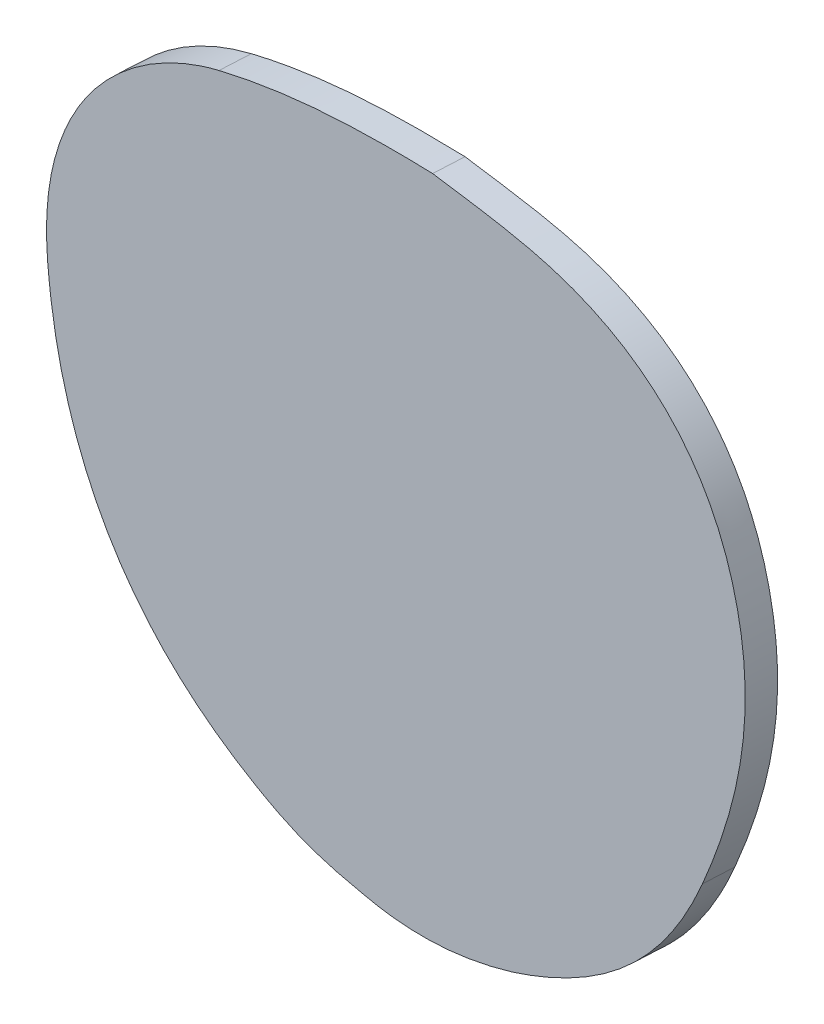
ISO-10303-21;
HEADER;
FILE_DESCRIPTION(('STEP AP214'),'2;1');
FILE_NAME('part.step','',(''),(''),'','','');
FILE_SCHEMA(('AUTOMOTIVE_DESIGN { 1 0 10303 214 1 1 1 1 }'));
ENDSEC;
DATA;
#1=APPLICATION_CONTEXT('core data for automotive mechanical design processes');
#2=APPLICATION_PROTOCOL_DEFINITION('international standard','automotive_design',2000,#1);
#3=PRODUCT_CONTEXT('',#1,'mechanical');
#4=PRODUCT('Part','Part','',(#3));
#5=PRODUCT_RELATED_PRODUCT_CATEGORY('part','',(#4));
#6=PRODUCT_DEFINITION_FORMATION('','',#4);
#7=PRODUCT_DEFINITION_CONTEXT('part definition',#1,'design');
#8=PRODUCT_DEFINITION('design','',#6,#7);
#9=PRODUCT_DEFINITION_SHAPE('','',#8);
#10=(LENGTH_UNIT() NAMED_UNIT(*) SI_UNIT(.MILLI.,.METRE.));
#11=(NAMED_UNIT(*) PLANE_ANGLE_UNIT() SI_UNIT($,.RADIAN.));
#12=(NAMED_UNIT(*) SI_UNIT($,.STERADIAN.) SOLID_ANGLE_UNIT());
#13=UNCERTAINTY_MEASURE_WITH_UNIT(LENGTH_MEASURE(1.E-05),#10,'distance_accuracy_value','');
#14=(GEOMETRIC_REPRESENTATION_CONTEXT(3) GLOBAL_UNCERTAINTY_ASSIGNED_CONTEXT((#13)) GLOBAL_UNIT_ASSIGNED_CONTEXT((#10,
#11,#12)) REPRESENTATION_CONTEXT('',''));
#15=CARTESIAN_POINT('',(0.,0.,0.));
#16=DIRECTION('',(0.,0.,1.));
#17=DIRECTION('',(1.,0.,0.));
#18=AXIS2_PLACEMENT_3D('',#15,#16,#17);
#19=CARTESIAN_POINT('',(66.9105713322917,14.0227928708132,27.8834045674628));
#20=CARTESIAN_POINT('',(66.081443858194,13.7430929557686,27.8399518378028));
#21=CARTESIAN_POINT('',(65.2419844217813,13.5010499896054,27.7959576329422));
#22=CARTESIAN_POINT('',(63.5373344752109,13.1107462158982,27.7066207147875));
#23=CARTESIAN_POINT('',(62.674721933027,12.9634372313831,27.66141310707));
#24=CARTESIAN_POINT('',(60.9373126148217,12.782456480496,27.5703593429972));
#25=CARTESIAN_POINT('',(60.0609155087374,12.7491919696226,27.5244293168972));
#26=CARTESIAN_POINT('',(58.3220449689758,12.8047402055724,27.4332989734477));
#27=CARTESIAN_POINT('',(57.4559455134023,12.8935967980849,27.3879086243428));
#28=CARTESIAN_POINT('',(56.5930362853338,13.0408700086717,27.3426854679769));
#29=B_SPLINE_CURVE_WITH_KNOTS('',3,(#19,#20,#21,#22,#23,#24,#25,#26,#27,#28),.UNSPECIFIED.,.F.,
.F.,(4,2,2,2,4),(0.,0.25,0.5,0.75,1.),.UNSPECIFIED.);
#30=DIRECTION('',(-0.0523359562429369,0.,0.998629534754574));
#31=VECTOR('',#30,1.);
#32=SURFACE_OF_LINEAR_EXTRUSION('',#29,#31);
#33=CARTESIAN_POINT('',(66.8058994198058,14.0227928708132,29.880663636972));
#34=CARTESIAN_POINT('',(65.9767719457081,13.7430929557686,29.837210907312));
#35=CARTESIAN_POINT('',(65.1373125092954,13.5010499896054,29.7932167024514));
#36=CARTESIAN_POINT('',(63.432662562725,13.1107462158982,29.7038797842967));
#37=CARTESIAN_POINT('',(62.5700500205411,12.9634372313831,29.6586721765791));
#38=CARTESIAN_POINT('',(60.8326407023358,12.7824564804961,29.5676184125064));
#39=CARTESIAN_POINT('',(59.9562435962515,12.7491919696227,29.5216883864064));
#40=CARTESIAN_POINT('',(58.21737305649,12.8047402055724,29.4305580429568));
#41=CARTESIAN_POINT('',(57.3512736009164,12.8935967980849,29.3851676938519));
#42=CARTESIAN_POINT('',(56.4883643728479,13.0408700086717,29.339944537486));
#43=B_SPLINE_CURVE_WITH_KNOTS('',3,(#33,#34,#35,#36,#37,#38,#39,#40,#41,#42),.UNSPECIFIED.,.F.,
.F.,(4,2,2,2,4),(0.,0.25,0.5,0.75,1.),.UNSPECIFIED.);
#44=CARTESIAN_POINT('',(66.8058994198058,14.0227928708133,29.880663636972));
#45=VERTEX_POINT('',#44);
#46=CARTESIAN_POINT('',(56.4883643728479,13.0408700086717,29.339944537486));
#47=VERTEX_POINT('',#46);
#48=EDGE_CURVE('E329',#45,#47,#43,.T.);
#49=ORIENTED_EDGE('',*,*,#48,.T.);
#50=DIRECTION('',(-0.0523359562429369,0.,0.998629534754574));
#51=VECTOR('',#50,1.);
#52=CARTESIAN_POINT('',(56.5930362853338,13.0408700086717,27.3426854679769));
#53=LINE('',#52,#51);
#54=CARTESIAN_POINT('',(56.5930362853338,13.0408700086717,27.3426854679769));
#55=VERTEX_POINT('',#54);
#56=EDGE_CURVE('E11',#55,#47,#53,.T.);
#57=ORIENTED_EDGE('',*,*,#56,.F.);
#58=CARTESIAN_POINT('',(56.5930362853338,13.0408700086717,27.3426854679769));
#59=CARTESIAN_POINT('',(57.4559455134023,12.8935967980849,27.3879086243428));
#60=CARTESIAN_POINT('',(58.3220449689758,12.8047402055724,27.4332989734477));
#61=CARTESIAN_POINT('',(60.0609155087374,12.7491919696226,27.5244293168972));
#62=CARTESIAN_POINT('',(60.9373126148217,12.782456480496,27.5703593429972));
#63=CARTESIAN_POINT('',(62.674721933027,12.9634372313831,27.66141310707));
#64=CARTESIAN_POINT('',(63.5373344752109,13.1107462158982,27.7066207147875));
#65=CARTESIAN_POINT('',(65.2419844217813,13.5010499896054,27.7959576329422));
#66=CARTESIAN_POINT('',(66.081443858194,13.7430929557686,27.8399518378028));
#67=CARTESIAN_POINT('',(66.9105713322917,14.0227928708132,27.8834045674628));
#68=B_SPLINE_CURVE_WITH_KNOTS('',3,(#58,#59,#60,#61,#62,#63,#64,#65,#66,#67),.UNSPECIFIED.,.F.,
.F.,(4,2,2,2,4),(0.,0.25,0.5,0.75,1.),.UNSPECIFIED.);
#69=CARTESIAN_POINT('',(66.9105713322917,14.0227928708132,27.8834045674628));
#70=VERTEX_POINT('',#69);
#71=EDGE_CURVE('E320',#70,#55,#68,.F.);
#72=ORIENTED_EDGE('',*,*,#71,.F.);
#73=DIRECTION('',(-0.0523359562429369,0.,0.998629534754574));
#74=VECTOR('',#73,1.);
#75=CARTESIAN_POINT('',(66.9105713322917,14.0227928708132,27.8834045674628));
#76=LINE('',#75,#74);
#77=EDGE_CURVE('E336',#70,#45,#76,.T.);
#78=ORIENTED_EDGE('',*,*,#77,.T.);
#79=EDGE_LOOP('',(#49,#57,#72,#78));
#80=FACE_BOUND('',#79,.T.);
#81=ADVANCED_FACE('F45',(#80),#32,.F.);
#82=CARTESIAN_POINT('',(56.5930362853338,13.0408700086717,27.3426854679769));
#83=CARTESIAN_POINT('',(55.9663635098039,13.1306969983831,27.3098429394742));
#84=CARTESIAN_POINT('',(55.3420453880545,13.2332759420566,27.2771238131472));
#85=CARTESIAN_POINT('',(54.1017208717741,13.4834471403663,27.2121211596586));
#86=CARTESIAN_POINT('',(53.4850531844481,13.631666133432,27.1798029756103));
#87=CARTESIAN_POINT('',(52.2731162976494,13.9922876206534,27.1162880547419));
#88=CARTESIAN_POINT('',(51.6762746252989,14.2064022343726,27.0850089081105));
#89=CARTESIAN_POINT('',(50.5070497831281,14.6916248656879,27.0237324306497));
#90=CARTESIAN_POINT('',(49.9343981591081,14.9611293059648,26.993721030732));
#91=CARTESIAN_POINT('',(49.3667500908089,15.2418839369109,26.9639718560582));
#92=B_SPLINE_CURVE_WITH_KNOTS('',3,(#82,#83,#84,#85,#86,#87,#88,#89,#90,#91),.UNSPECIFIED.,.F.,
.F.,(4,2,2,2,4),(0.,0.25,0.5,0.75,1.),.UNSPECIFIED.);
#93=DIRECTION('',(-0.0523359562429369,0.,0.998629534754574));
#94=VECTOR('',#93,1.);
#95=SURFACE_OF_LINEAR_EXTRUSION('',#92,#94);
#96=CARTESIAN_POINT('',(56.4883643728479,13.0408700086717,29.339944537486));
#97=CARTESIAN_POINT('',(55.861691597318,13.1306969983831,29.3071020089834));
#98=CARTESIAN_POINT('',(55.2373734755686,13.2332759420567,29.2743828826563));
#99=CARTESIAN_POINT('',(53.9970489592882,13.4834471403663,29.2093802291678));
#100=CARTESIAN_POINT('',(53.3803812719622,13.631666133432,29.1770620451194));
#101=CARTESIAN_POINT('',(52.1684443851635,13.9922876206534,29.1135471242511));
#102=CARTESIAN_POINT('',(51.571602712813,14.2064022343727,29.0822679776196));
#103=CARTESIAN_POINT('',(50.4023778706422,14.6916248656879,29.0209915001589));
#104=CARTESIAN_POINT('',(49.8297262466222,14.9611293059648,28.9909801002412));
#105=CARTESIAN_POINT('',(49.2620781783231,15.2418839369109,28.9612309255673));
#106=B_SPLINE_CURVE_WITH_KNOTS('',3,(#96,#97,#98,#99,#100,#101,#102,#103,#104,#105),
.UNSPECIFIED.,.F.,.F.,(4,2,2,2,4),(0.,0.25,0.5,0.75,1.),.UNSPECIFIED.);
#107=CARTESIAN_POINT('',(49.2620781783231,15.2418839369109,28.9612309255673));
#108=VERTEX_POINT('',#107);
#109=EDGE_CURVE('E327',#47,#108,#106,.T.);
#110=ORIENTED_EDGE('',*,*,#109,.T.);
#111=DIRECTION('',(-0.0523359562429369,0.,0.998629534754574));
#112=VECTOR('',#111,1.);
#113=CARTESIAN_POINT('',(49.3667500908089,15.2418839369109,26.9639718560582));
#114=LINE('',#113,#112);
#115=CARTESIAN_POINT('',(49.3667500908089,15.2418839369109,26.9639718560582));
#116=VERTEX_POINT('',#115);
#117=EDGE_CURVE('E59',#116,#108,#114,.T.);
#118=ORIENTED_EDGE('',*,*,#117,.F.);
#119=CARTESIAN_POINT('',(49.3667500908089,15.2418839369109,26.9639718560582));
#120=CARTESIAN_POINT('',(49.9343981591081,14.9611293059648,26.993721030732));
#121=CARTESIAN_POINT('',(50.5070497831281,14.6916248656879,27.0237324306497));
#122=CARTESIAN_POINT('',(51.6762746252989,14.2064022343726,27.0850089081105));
#123=CARTESIAN_POINT('',(52.2731162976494,13.9922876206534,27.1162880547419));
#124=CARTESIAN_POINT('',(53.4850531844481,13.631666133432,27.1798029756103));
#125=CARTESIAN_POINT('',(54.1017208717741,13.4834471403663,27.2121211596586));
#126=CARTESIAN_POINT('',(55.3420453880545,13.2332759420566,27.2771238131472));
#127=CARTESIAN_POINT('',(55.9663635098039,13.1306969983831,27.3098429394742));
#128=CARTESIAN_POINT('',(56.5930362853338,13.0408700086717,27.3426854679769));
#129=B_SPLINE_CURVE_WITH_KNOTS('',3,(#119,#120,#121,#122,#123,#124,#125,#126,#127,#128),
.UNSPECIFIED.,.F.,.F.,(4,2,2,2,4),(0.,0.25,0.5,0.75,1.),.UNSPECIFIED.);
#130=EDGE_CURVE('E111',#55,#116,#129,.F.);
#131=ORIENTED_EDGE('',*,*,#130,.F.);
#132=ORIENTED_EDGE('',*,*,#56,.T.);
#133=EDGE_LOOP('',(#110,#118,#131,#132));
#134=FACE_BOUND('',#133,.T.);
#135=ADVANCED_FACE('F239',(#134),#95,.F.);
#136=CARTESIAN_POINT('',(49.3667500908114,15.2418839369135,26.9639718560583));
#137=CARTESIAN_POINT('',(47.2853127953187,16.2713546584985,26.8548883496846));
#138=CARTESIAN_POINT('',(45.3523239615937,17.5123714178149,26.7535846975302));
#139=CARTESIAN_POINT('',(43.1720148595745,19.3998493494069,26.6393195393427));
#140=CARTESIAN_POINT('',(42.7473291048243,19.7947664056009,26.6170627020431));
#141=CARTESIAN_POINT('',(41.9253751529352,20.6186401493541,26.5739859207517));
#142=CARTESIAN_POINT('',(40.7468886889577,21.8919804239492,26.5122240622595));
#143=CARTESIAN_POINT('',(39.7294220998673,23.2763149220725,26.4589008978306));
#144=CARTESIAN_POINT('',(38.5116476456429,25.2178047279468,26.395080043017));
#145=CARTESIAN_POINT('',(37.9715387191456,26.237852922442,26.3667741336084));
#146=CARTESIAN_POINT('',(37.0283607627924,28.3646744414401,26.3173442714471));
#147=CARTESIAN_POINT('',(36.6353715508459,29.4473907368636,26.2967485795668));
#148=CARTESIAN_POINT('',(35.6544069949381,32.7441727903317,26.2453384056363));
#149=CARTESIAN_POINT('',(35.2625608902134,35.0064114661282,26.2248026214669));
#150=CARTESIAN_POINT('',(35.0648344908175,37.3163294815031,26.2144402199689));
#151=B_SPLINE_CURVE_WITH_KNOTS('',3,(#136,#137,#138,#139,#140,#141,#142,#143,#144,#145,#146,
#147,#148,#149,#150),.UNSPECIFIED.,.F.,.F.,(4,2,2,1,2,2,2,4),(0.,0.25,0.3125,0.375,0.5,0.625,
0.75,1.),.UNSPECIFIED.);
#152=DIRECTION('',(-0.0523359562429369,0.,0.998629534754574));
#153=VECTOR('',#152,1.);
#154=SURFACE_OF_LINEAR_EXTRUSION('',#151,#153);
#155=CARTESIAN_POINT('',(49.2620781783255,15.2418839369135,28.9612309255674));
#156=CARTESIAN_POINT('',(47.1806408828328,16.2713546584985,28.8521474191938));
#157=CARTESIAN_POINT('',(45.2476520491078,17.512371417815,28.7508437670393));
#158=CARTESIAN_POINT('',(43.0673429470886,19.3998493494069,28.6365786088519));
#159=CARTESIAN_POINT('',(42.6426571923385,19.7947664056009,28.6143217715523));
#160=CARTESIAN_POINT('',(41.8207032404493,20.6186401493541,28.5712449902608));
#161=CARTESIAN_POINT('',(40.6422167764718,21.8919804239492,28.5094831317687));
#162=CARTESIAN_POINT('',(39.6247501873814,23.2763149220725,28.4561599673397));
#163=CARTESIAN_POINT('',(38.406975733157,25.2178047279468,28.3923391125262));
#164=CARTESIAN_POINT('',(37.8668668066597,26.237852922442,28.3640332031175));
#165=CARTESIAN_POINT('',(36.9236888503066,28.3646744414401,28.3146033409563));
#166=CARTESIAN_POINT('',(36.53069963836,29.4473907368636,28.294007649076));
#167=CARTESIAN_POINT('',(35.5497350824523,32.7441727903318,28.2425974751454));
#168=CARTESIAN_POINT('',(35.1578889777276,35.0064114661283,28.2220616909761));
#169=CARTESIAN_POINT('',(34.9601625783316,37.3163294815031,28.2116992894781));
#170=B_SPLINE_CURVE_WITH_KNOTS('',3,(#155,#156,#157,#158,#159,#160,#161,#162,#163,#164,#165,
#166,#167,#168,#169),.UNSPECIFIED.,.F.,.F.,(4,2,2,1,2,2,2,4),(0.,0.25,0.3125,0.375,0.5,0.625,
0.75,1.),.UNSPECIFIED.);
#171=CARTESIAN_POINT('',(34.9601625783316,37.3163294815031,28.2116992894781));
#172=VERTEX_POINT('',#171);
#173=EDGE_CURVE('E314',#108,#172,#170,.T.);
#174=ORIENTED_EDGE('',*,*,#173,.T.);
#175=DIRECTION('',(-0.0523359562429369,0.,0.998629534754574));
#176=VECTOR('',#175,1.);
#177=CARTESIAN_POINT('',(35.0648344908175,37.3163294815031,26.2144402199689));
#178=LINE('',#177,#176);
#179=CARTESIAN_POINT('',(35.0648344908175,37.3163294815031,26.2144402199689));
#180=VERTEX_POINT('',#179);
#181=EDGE_CURVE('E313',#180,#172,#178,.T.);
#182=ORIENTED_EDGE('',*,*,#181,.F.);
#183=CARTESIAN_POINT('',(35.0648344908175,37.3163294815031,26.2144402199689));
#184=CARTESIAN_POINT('',(35.2625608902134,35.0064114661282,26.2248026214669));
#185=CARTESIAN_POINT('',(35.6544069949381,32.7441727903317,26.2453384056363));
#186=CARTESIAN_POINT('',(36.6353715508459,29.4473907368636,26.2967485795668));
#187=CARTESIAN_POINT('',(37.0283607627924,28.3646744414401,26.3173442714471));
#188=CARTESIAN_POINT('',(37.9715387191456,26.237852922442,26.3667741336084));
#189=CARTESIAN_POINT('',(38.5116476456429,25.2178047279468,26.395080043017));
#190=CARTESIAN_POINT('',(39.7294220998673,23.2763149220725,26.4589008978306));
#191=CARTESIAN_POINT('',(40.7468886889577,21.8919804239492,26.5122240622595));
#192=CARTESIAN_POINT('',(41.9253751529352,20.6186401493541,26.5739859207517));
#193=CARTESIAN_POINT('',(42.7473291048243,19.7947664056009,26.6170627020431));
#194=CARTESIAN_POINT('',(43.1720148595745,19.3998493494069,26.6393195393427));
#195=CARTESIAN_POINT('',(45.3523239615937,17.5123714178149,26.7535846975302));
#196=CARTESIAN_POINT('',(47.2853127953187,16.2713546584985,26.8548883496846));
#197=CARTESIAN_POINT('',(49.3667500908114,15.2418839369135,26.9639718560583));
#198=B_SPLINE_CURVE_WITH_KNOTS('',3,(#183,#184,#185,#186,#187,#188,#189,#190,#191,#192,#193,
#194,#195,#196,#197),.UNSPECIFIED.,.F.,.F.,(4,2,2,2,1,2,2,4),(0.,0.25,0.375,0.5,0.625,0.6875,
0.75,1.),.UNSPECIFIED.);
#199=EDGE_CURVE('E307',#116,#180,#198,.F.);
#200=ORIENTED_EDGE('',*,*,#199,.F.);
#201=ORIENTED_EDGE('',*,*,#117,.T.);
#202=EDGE_LOOP('',(#174,#182,#200,#201));
#203=FACE_BOUND('',#202,.T.);
#204=ADVANCED_FACE('F249',(#203),#154,.F.);
#205=CARTESIAN_POINT('',(35.0648344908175,37.3163294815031,26.2144402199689));
#206=CARTESIAN_POINT('',(34.9848379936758,38.2508815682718,26.2102477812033));
#207=CARTESIAN_POINT('',(34.9717925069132,39.1807983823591,26.2095640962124));
#208=CARTESIAN_POINT('',(35.0966205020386,41.0301833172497,26.2161060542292));
#209=CARTESIAN_POINT('',(35.2347128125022,41.9511324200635,26.2233431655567));
#210=CARTESIAN_POINT('',(35.6850162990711,43.7748740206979,26.2469425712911));
#211=CARTESIAN_POINT('',(35.9904021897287,44.6503406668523,26.2629471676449));
#212=CARTESIAN_POINT('',(36.7603198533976,46.3290656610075,26.3032968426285));
#213=CARTESIAN_POINT('',(37.22587370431,47.133934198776,26.3276954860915));
#214=CARTESIAN_POINT('',(38.3170524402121,48.662537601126,26.3848817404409));
#215=CARTESIAN_POINT('',(38.9262834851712,49.3643301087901,26.4168101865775));
#216=CARTESIAN_POINT('',(39.9267436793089,50.3319465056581,26.4692420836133));
#217=CARTESIAN_POINT('',(40.2747506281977,50.6402234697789,26.4874803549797));
#218=CARTESIAN_POINT('',(40.9993427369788,51.2287077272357,26.5254546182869));
#219=CARTESIAN_POINT('',(41.3772037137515,51.5096257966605,26.5452574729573));
#220=CARTESIAN_POINT('',(42.5343250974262,52.2974398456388,26.6058996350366));
#221=CARTESIAN_POINT('',(43.341658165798,52.7545136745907,26.6482101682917));
#222=CARTESIAN_POINT('',(44.6042096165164,53.3423340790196,26.7143776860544));
#223=CARTESIAN_POINT('',(45.0337223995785,53.5218424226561,26.7368874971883));
#224=CARTESIAN_POINT('',(45.9106475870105,53.8469047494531,26.782845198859));
#225=CARTESIAN_POINT('',(46.3576089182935,53.9921810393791,26.8062694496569));
#226=CARTESIAN_POINT('',(46.8094144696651,54.118129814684,26.8299475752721));
#227=B_SPLINE_CURVE_WITH_KNOTS('',3,(#205,#206,#207,#208,#209,#210,#211,#212,#213,#214,#215,
#216,#217,#218,#219,#220,#221,#222,#223,#224,#225,#226),.UNSPECIFIED.,.F.,.F.,(4,2,2,2,2,2,2,2,
2,2,4),(0.,0.125,0.25,0.375,0.5,0.625,0.687500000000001,0.750000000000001,0.875000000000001,
0.9375,1.),.UNSPECIFIED.);
#228=DIRECTION('',(-0.0523359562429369,0.,0.998629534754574));
#229=VECTOR('',#228,1.);
#230=SURFACE_OF_LINEAR_EXTRUSION('',#227,#229);
#231=CARTESIAN_POINT('',(34.9601625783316,37.3163294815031,28.2116992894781));
#232=CARTESIAN_POINT('',(34.8801660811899,38.2508815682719,28.2075068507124));
#233=CARTESIAN_POINT('',(34.8671205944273,39.1807983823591,28.2068231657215));
#234=CARTESIAN_POINT('',(34.9919485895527,41.0301833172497,28.2133651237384));
#235=CARTESIAN_POINT('',(35.1300409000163,41.9511324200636,28.2206022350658));
#236=CARTESIAN_POINT('',(35.5803443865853,43.774874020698,28.2442016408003));
#237=CARTESIAN_POINT('',(35.8857302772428,44.6503406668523,28.260206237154));
#238=CARTESIAN_POINT('',(36.6556479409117,46.3290656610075,28.3005559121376));
#239=CARTESIAN_POINT('',(37.1212017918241,47.1339341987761,28.3249545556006));
#240=CARTESIAN_POINT('',(38.2123805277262,48.662537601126,28.3821408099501));
#241=CARTESIAN_POINT('',(38.8216115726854,49.3643301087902,28.4140692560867));
#242=CARTESIAN_POINT('',(39.822071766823,50.3319465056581,28.4665011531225));
#243=CARTESIAN_POINT('',(40.1700787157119,50.6402234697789,28.4847394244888));
#244=CARTESIAN_POINT('',(40.8946708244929,51.2287077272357,28.522713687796));
#245=CARTESIAN_POINT('',(41.2725318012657,51.5096257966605,28.5425165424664));
#246=CARTESIAN_POINT('',(42.4296531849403,52.2974398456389,28.6031587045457));
#247=CARTESIAN_POINT('',(43.2369862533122,52.7545136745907,28.6454692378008));
#248=CARTESIAN_POINT('',(44.4995377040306,53.3423340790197,28.7116367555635));
#249=CARTESIAN_POINT('',(44.9290504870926,53.5218424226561,28.7341465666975));
#250=CARTESIAN_POINT('',(45.8059756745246,53.8469047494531,28.7801042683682));
#251=CARTESIAN_POINT('',(46.2529370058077,53.9921810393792,28.8035285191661));
#252=CARTESIAN_POINT('',(46.7047425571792,54.1181298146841,28.8272066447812));
#253=B_SPLINE_CURVE_WITH_KNOTS('',3,(#231,#232,#233,#234,#235,#236,#237,#238,#239,#240,#241,
#242,#243,#244,#245,#246,#247,#248,#249,#250,#251,#252),.UNSPECIFIED.,.F.,.F.,(4,2,2,2,2,2,2,2,
2,2,4),(0.,0.125,0.25,0.375,0.5,0.625,0.687500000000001,0.750000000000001,0.875000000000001,
0.9375,1.),.UNSPECIFIED.);
#254=CARTESIAN_POINT('',(46.7047425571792,54.1181298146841,28.8272066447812));
#255=VERTEX_POINT('',#254);
#256=EDGE_CURVE('E298',#172,#255,#253,.T.);
#257=ORIENTED_EDGE('',*,*,#256,.T.);
#258=DIRECTION('',(-0.0523359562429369,0.,0.998629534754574));
#259=VECTOR('',#258,1.);
#260=CARTESIAN_POINT('',(46.8094144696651,54.118129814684,26.8299475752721));
#261=LINE('',#260,#259);
#262=CARTESIAN_POINT('',(46.8094144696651,54.118129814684,26.8299475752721));
#263=VERTEX_POINT('',#262);
#264=EDGE_CURVE('E145',#263,#255,#261,.T.);
#265=ORIENTED_EDGE('',*,*,#264,.F.);
#266=CARTESIAN_POINT('',(46.8094144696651,54.118129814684,26.8299475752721));
#267=CARTESIAN_POINT('',(46.3576089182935,53.9921810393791,26.8062694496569));
#268=CARTESIAN_POINT('',(45.9106475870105,53.8469047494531,26.782845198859));
#269=CARTESIAN_POINT('',(45.0337223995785,53.5218424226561,26.7368874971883));
#270=CARTESIAN_POINT('',(44.6042096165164,53.3423340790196,26.7143776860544));
#271=CARTESIAN_POINT('',(43.341658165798,52.7545136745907,26.6482101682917));
#272=CARTESIAN_POINT('',(42.5343250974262,52.2974398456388,26.6058996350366));
#273=CARTESIAN_POINT('',(41.3772037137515,51.5096257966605,26.5452574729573));
#274=CARTESIAN_POINT('',(40.9993427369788,51.2287077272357,26.5254546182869));
#275=CARTESIAN_POINT('',(40.2747506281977,50.6402234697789,26.4874803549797));
#276=CARTESIAN_POINT('',(39.9267436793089,50.3319465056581,26.4692420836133));
#277=CARTESIAN_POINT('',(38.9262834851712,49.3643301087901,26.4168101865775));
#278=CARTESIAN_POINT('',(38.3170524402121,48.662537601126,26.3848817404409));
#279=CARTESIAN_POINT('',(37.22587370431,47.133934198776,26.3276954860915));
#280=CARTESIAN_POINT('',(36.7603198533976,46.3290656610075,26.3032968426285));
#281=CARTESIAN_POINT('',(35.9904021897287,44.6503406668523,26.2629471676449));
#282=CARTESIAN_POINT('',(35.6850162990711,43.7748740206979,26.2469425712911));
#283=CARTESIAN_POINT('',(35.2347128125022,41.9511324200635,26.2233431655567));
#284=CARTESIAN_POINT('',(35.0966205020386,41.0301833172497,26.2161060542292));
#285=CARTESIAN_POINT('',(34.9717925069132,39.1807983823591,26.2095640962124));
#286=CARTESIAN_POINT('',(34.9848379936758,38.2508815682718,26.2102477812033));
#287=CARTESIAN_POINT('',(35.0648344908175,37.3163294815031,26.2144402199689));
#288=B_SPLINE_CURVE_WITH_KNOTS('',3,(#266,#267,#268,#269,#270,#271,#272,#273,#274,#275,#276,
#277,#278,#279,#280,#281,#282,#283,#284,#285,#286,#287),.UNSPECIFIED.,.F.,.F.,(4,2,2,2,2,2,2,2,
2,2,4),(0.,0.0624999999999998,0.124999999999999,0.249999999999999,0.312499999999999,0.375,0.5,
0.625,0.75,0.875,1.),.UNSPECIFIED.);
#289=EDGE_CURVE('E130',#180,#263,#288,.F.);
#290=ORIENTED_EDGE('',*,*,#289,.F.);
#291=ORIENTED_EDGE('',*,*,#181,.T.);
#292=EDGE_LOOP('',(#257,#265,#290,#291));
#293=FACE_BOUND('',#292,.T.);
#294=ADVANCED_FACE('F274',(#293),#230,.F.);
#295=CARTESIAN_POINT('',(46.809415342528,54.1181300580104,26.8299476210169));
#296=CARTESIAN_POINT('',(47.9981777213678,54.4495197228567,26.8922480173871));
#297=CARTESIAN_POINT('',(49.1978552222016,54.7326313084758,26.9551204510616));
#298=CARTESIAN_POINT('',(51.6187878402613,55.2034157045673,27.081996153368));
#299=CARTESIAN_POINT('',(52.8388447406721,55.3910262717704,27.1459366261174));
#300=CARTESIAN_POINT('',(55.2869607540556,55.6856692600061,27.2742369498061));
#301=CARTESIAN_POINT('',(56.5166745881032,55.7932641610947,27.3386835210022));
#302=CARTESIAN_POINT('',(58.977558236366,55.9494682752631,27.4676529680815));
#303=CARTESIAN_POINT('',(60.2095936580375,55.9983341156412,27.5322212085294));
#304=CARTESIAN_POINT('',(61.4427234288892,56.0271229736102,27.5968468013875));
#305=B_SPLINE_CURVE_WITH_KNOTS('',3,(#295,#296,#297,#298,#299,#300,#301,#302,#303,#304),
.UNSPECIFIED.,.F.,.F.,(4,2,2,2,4),(0.,0.249999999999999,0.499999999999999,0.749999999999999,1.),.UNSPECIFIED.);
#306=DIRECTION('',(-0.0523359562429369,0.,0.998629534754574));
#307=VECTOR('',#306,1.);
#308=SURFACE_OF_LINEAR_EXTRUSION('',#305,#307);
#309=CARTESIAN_POINT('',(46.7047434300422,54.1181300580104,28.827206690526));
#310=CARTESIAN_POINT('',(47.8935058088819,54.4495197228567,28.8895070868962));
#311=CARTESIAN_POINT('',(49.0931833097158,54.7326313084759,28.9523795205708));
#312=CARTESIAN_POINT('',(51.5141159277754,55.2034157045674,29.0792552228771));
#313=CARTESIAN_POINT('',(52.7341728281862,55.3910262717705,29.1431956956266));
#314=CARTESIAN_POINT('',(55.1822888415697,55.6856692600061,29.2714960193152));
#315=CARTESIAN_POINT('',(56.4120026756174,55.7932641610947,29.3359425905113));
#316=CARTESIAN_POINT('',(58.8728863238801,55.9494682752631,29.4649120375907));
#317=CARTESIAN_POINT('',(60.1049217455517,55.9983341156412,29.5294802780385));
#318=CARTESIAN_POINT('',(61.3380515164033,56.0271229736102,29.5941058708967));
#319=B_SPLINE_CURVE_WITH_KNOTS('',3,(#309,#310,#311,#312,#313,#314,#315,#316,#317,#318),
.UNSPECIFIED.,.F.,.F.,(4,2,2,2,4),(0.,0.249999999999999,0.499999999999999,0.749999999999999,1.),.UNSPECIFIED.);
#320=CARTESIAN_POINT('',(61.3380515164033,56.0271229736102,29.5941058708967));
#321=VERTEX_POINT('',#320);
#322=EDGE_CURVE('E142',#255,#321,#319,.T.);
#323=ORIENTED_EDGE('',*,*,#322,.T.);
#324=DIRECTION('',(-0.0523359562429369,0.,0.998629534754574));
#325=VECTOR('',#324,1.);
#326=CARTESIAN_POINT('',(61.4427234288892,56.0271229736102,27.5968468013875));
#327=LINE('',#326,#325);
#328=CARTESIAN_POINT('',(61.4427234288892,56.0271229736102,27.5968468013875));
#329=VERTEX_POINT('',#328);
#330=EDGE_CURVE('E139',#329,#321,#327,.T.);
#331=ORIENTED_EDGE('',*,*,#330,.F.);
#332=CARTESIAN_POINT('',(61.4427234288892,56.0271229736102,27.5968468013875));
#333=CARTESIAN_POINT('',(60.2095936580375,55.9983341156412,27.5322212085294));
#334=CARTESIAN_POINT('',(58.977558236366,55.9494682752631,27.4676529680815));
#335=CARTESIAN_POINT('',(56.5166745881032,55.7932641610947,27.3386835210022));
#336=CARTESIAN_POINT('',(55.2869607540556,55.6856692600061,27.2742369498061));
#337=CARTESIAN_POINT('',(52.8388447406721,55.3910262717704,27.1459366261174));
#338=CARTESIAN_POINT('',(51.6187878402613,55.2034157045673,27.081996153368));
#339=CARTESIAN_POINT('',(49.1978552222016,54.7326313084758,26.9551204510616));
#340=CARTESIAN_POINT('',(47.9981777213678,54.4495197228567,26.8922480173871));
#341=CARTESIAN_POINT('',(46.809415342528,54.1181300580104,26.8299476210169));
#342=B_SPLINE_CURVE_WITH_KNOTS('',3,(#332,#333,#334,#335,#336,#337,#338,#339,#340,#341),
.UNSPECIFIED.,.F.,.F.,(4,2,2,2,4),(0.,0.250000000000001,0.500000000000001,0.750000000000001,1.),.UNSPECIFIED.);
#343=EDGE_CURVE('E122',#263,#329,#342,.F.);
#344=ORIENTED_EDGE('',*,*,#343,.F.);
#345=ORIENTED_EDGE('',*,*,#264,.T.);
#346=EDGE_LOOP('',(#323,#331,#344,#345));
#347=FACE_BOUND('',#346,.T.);
#348=ADVANCED_FACE('F140',(#347),#308,.F.);
#349=CARTESIAN_POINT('',(61.4427234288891,56.0271229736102,27.5968468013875));
#350=CARTESIAN_POINT('',(61.9021713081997,55.9781121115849,27.6209254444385));
#351=CARTESIAN_POINT('',(62.3626258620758,55.9390487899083,27.6450568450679));
#352=CARTESIAN_POINT('',(63.2832615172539,55.8582200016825,27.6933053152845));
#353=CARTESIAN_POINT('',(63.7435559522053,55.8175744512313,27.7174283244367));
#354=CARTESIAN_POINT('',(65.1234464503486,55.6858272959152,27.7897453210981));
#355=CARTESIAN_POINT('',(66.0428680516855,55.5852804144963,27.8379301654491));
#356=CARTESIAN_POINT('',(67.8728295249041,55.3300644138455,27.933834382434));
#357=CARTESIAN_POINT('',(68.7809691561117,55.177570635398,27.9814279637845));
#358=CARTESIAN_POINT('',(70.5661008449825,54.7592780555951,28.074982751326));
#359=CARTESIAN_POINT('',(71.4444240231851,54.4983214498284,28.1210137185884));
#360=CARTESIAN_POINT('',(72.735847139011,54.0120824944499,28.1886943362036));
#361=CARTESIAN_POINT('',(73.161960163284,53.8341376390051,28.2110259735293));
#362=CARTESIAN_POINT('',(74.0043951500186,53.442631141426,28.2551761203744));
#363=CARTESIAN_POINT('',(74.4185938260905,53.229860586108,28.2768833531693));
#364=CARTESIAN_POINT('',(75.6230707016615,52.5455562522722,28.3400073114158));
#365=CARTESIAN_POINT('',(76.38148597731,52.0253679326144,28.3797541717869));
#366=CARTESIAN_POINT('',(77.4451285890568,51.1388764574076,28.4354973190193));
#367=CARTESIAN_POINT('',(77.7882798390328,50.8246729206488,28.4534811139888));
#368=CARTESIAN_POINT('',(78.4442285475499,50.1629296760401,28.4878579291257));
#369=CARTESIAN_POINT('',(78.7537084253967,49.8189262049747,28.5040770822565));
#370=CARTESIAN_POINT('',(79.6287224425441,48.7489813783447,28.5499346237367));
#371=CARTESIAN_POINT('',(80.1409120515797,47.9851631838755,28.5767773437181));
#372=CARTESIAN_POINT('',(80.8090886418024,46.7683551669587,28.6117949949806));
#373=CARTESIAN_POINT('',(81.0159261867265,46.3488429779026,28.6226348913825));
#374=CARTESIAN_POINT('',(81.3914238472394,45.5002346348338,28.6423138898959));
#375=CARTESIAN_POINT('',(81.5606045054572,45.0706698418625,28.6511802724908));
#376=CARTESIAN_POINT('',(82.0179445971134,43.7677525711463,28.6751484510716));
#377=CARTESIAN_POINT('',(82.2562087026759,42.8802640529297,28.687635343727));
#378=CARTESIAN_POINT('',(82.5297868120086,41.5252844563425,28.7019729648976));
#379=CARTESIAN_POINT('',(82.6063079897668,41.0694679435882,28.705983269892));
#380=CARTESIAN_POINT('',(82.7289199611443,40.1492135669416,28.7124090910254));
#381=CARTESIAN_POINT('',(82.7747256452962,39.6860389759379,28.7148096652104));
#382=CARTESIAN_POINT('',(82.8650232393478,38.3023758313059,28.7195419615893));
#383=CARTESIAN_POINT('',(82.8631511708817,37.3820100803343,28.7194438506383));
#384=CARTESIAN_POINT('',(82.7453108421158,35.5450952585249,28.7132681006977));
#385=CARTESIAN_POINT('',(82.6290774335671,34.6270552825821,28.7071765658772));
#386=CARTESIAN_POINT('',(82.2959785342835,32.8006339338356,28.6897195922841));
#387=CARTESIAN_POINT('',(82.08142584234,31.9027988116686,28.6784753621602));
#388=CARTESIAN_POINT('',(81.3232428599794,29.2459760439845,28.6387406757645));
#389=CARTESIAN_POINT('',(80.6660129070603,27.5233746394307,28.6042967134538));
#390=CARTESIAN_POINT('',(79.9210671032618,25.828868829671,28.5652557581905));
#391=B_SPLINE_CURVE_WITH_KNOTS('',3,(#349,#350,#351,#352,#353,#354,#355,#356,#357,#358,#359,
#360,#361,#362,#363,#364,#365,#366,#367,#368,#369,#370,#371,#372,#373,#374,#375,#376,#377,#378,
#379,#380,#381,#382,#383,#384,#385,#386,#387,#388,#389,#390),.UNSPECIFIED.,.F.,.F.,(4,2,2,2,2,2,
2,2,2,2,2,2,2,2,2,2,2,2,2,2,4),(0.,0.0312499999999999,0.0624999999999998,0.125,0.1875,
0.250000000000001,0.281250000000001,0.312500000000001,0.375000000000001,0.406250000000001,
0.437500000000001,0.500000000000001,0.531250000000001,0.562500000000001,0.625000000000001,
0.656250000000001,0.687500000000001,0.750000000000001,0.812500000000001,0.875,1.),.UNSPECIFIED.);
#392=DIRECTION('',(-0.0523359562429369,0.,0.998629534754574));
#393=VECTOR('',#392,1.);
#394=SURFACE_OF_LINEAR_EXTRUSION('',#391,#393);
#395=CARTESIAN_POINT('',(61.3380515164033,56.0271229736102,29.5941058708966));
#396=CARTESIAN_POINT('',(61.7974993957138,55.9781121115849,29.6181845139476));
#397=CARTESIAN_POINT('',(62.25795394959,55.9390487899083,29.642315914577));
#398=CARTESIAN_POINT('',(63.178589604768,55.8582200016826,29.6905643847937));
#399=CARTESIAN_POINT('',(63.6388840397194,55.8175744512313,29.7146873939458));
#400=CARTESIAN_POINT('',(65.0187745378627,55.6858272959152,29.7870043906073));
#401=CARTESIAN_POINT('',(65.9381961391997,55.5852804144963,29.8351892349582));
#402=CARTESIAN_POINT('',(67.7681576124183,55.3300644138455,29.9310934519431));
#403=CARTESIAN_POINT('',(68.6762972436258,55.177570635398,29.9786870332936));
#404=CARTESIAN_POINT('',(70.4614289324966,54.7592780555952,30.0722418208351));
#405=CARTESIAN_POINT('',(71.3397521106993,54.4983214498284,30.1182727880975));
#406=CARTESIAN_POINT('',(72.6311752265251,54.0120824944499,30.1859534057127));
#407=CARTESIAN_POINT('',(73.0572882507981,53.8341376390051,30.2082850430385));
#408=CARTESIAN_POINT('',(73.8997232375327,53.442631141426,30.2524351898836));
#409=CARTESIAN_POINT('',(74.3139219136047,53.229860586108,30.2741424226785));
#410=CARTESIAN_POINT('',(75.5183987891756,52.5455562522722,30.3372663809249));
#411=CARTESIAN_POINT('',(76.2768140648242,52.0253679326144,30.377013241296));
#412=CARTESIAN_POINT('',(77.3404566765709,51.1388764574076,30.4327563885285));
#413=CARTESIAN_POINT('',(77.6836079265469,50.8246729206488,30.4507401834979));
#414=CARTESIAN_POINT('',(78.339556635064,50.1629296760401,30.4851169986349));
#415=CARTESIAN_POINT('',(78.6490365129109,49.8189262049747,30.5013361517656));
#416=CARTESIAN_POINT('',(79.5240505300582,48.7489813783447,30.5471936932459));
#417=CARTESIAN_POINT('',(80.0362401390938,47.9851631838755,30.5740364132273));
#418=CARTESIAN_POINT('',(80.7044167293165,46.7683551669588,30.6090540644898));
#419=CARTESIAN_POINT('',(80.9112542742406,46.3488429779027,30.6198939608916));
#420=CARTESIAN_POINT('',(81.2867519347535,45.5002346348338,30.6395729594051));
#421=CARTESIAN_POINT('',(81.4559325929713,45.0706698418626,30.6484393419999));
#422=CARTESIAN_POINT('',(81.9132726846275,43.7677525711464,30.6724075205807));
#423=CARTESIAN_POINT('',(82.15153679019,42.8802640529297,30.6848944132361));
#424=CARTESIAN_POINT('',(82.4251148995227,41.5252844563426,30.6992320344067));
#425=CARTESIAN_POINT('',(82.5016360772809,41.0694679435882,30.7032423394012));
#426=CARTESIAN_POINT('',(82.6242480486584,40.1492135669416,30.7096681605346));
#427=CARTESIAN_POINT('',(82.6700537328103,39.686038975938,30.7120687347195));
#428=CARTESIAN_POINT('',(82.760351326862,38.3023758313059,30.7168010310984));
#429=CARTESIAN_POINT('',(82.7584792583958,37.3820100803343,30.7167029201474));
#430=CARTESIAN_POINT('',(82.6406389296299,35.5450952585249,30.7105271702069));
#431=CARTESIAN_POINT('',(82.5244055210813,34.6270552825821,30.7044356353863));
#432=CARTESIAN_POINT('',(82.1913066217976,32.8006339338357,30.6869786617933));
#433=CARTESIAN_POINT('',(81.9767539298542,31.9027988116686,30.6757344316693));
#434=CARTESIAN_POINT('',(81.2185709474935,29.2459760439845,30.6359997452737));
#435=CARTESIAN_POINT('',(80.5613409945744,27.5233746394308,30.6015557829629));
#436=CARTESIAN_POINT('',(79.8163951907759,25.828868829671,30.5625148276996));
#437=B_SPLINE_CURVE_WITH_KNOTS('',3,(#395,#396,#397,#398,#399,#400,#401,#402,#403,#404,#405,
#406,#407,#408,#409,#410,#411,#412,#413,#414,#415,#416,#417,#418,#419,#420,#421,#422,#423,#424,
#425,#426,#427,#428,#429,#430,#431,#432,#433,#434,#435,#436),.UNSPECIFIED.,.F.,.F.,(4,2,2,2,2,2,
2,2,2,2,2,2,2,2,2,2,2,2,2,2,4),(0.,0.0312499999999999,0.0624999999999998,0.125,0.1875,
0.250000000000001,0.281250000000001,0.312500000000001,0.375000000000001,0.406250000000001,
0.437500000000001,0.500000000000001,0.531250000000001,0.562500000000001,0.625000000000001,
0.656250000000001,0.687500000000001,0.750000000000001,0.812500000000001,0.875,1.),.UNSPECIFIED.);
#438=CARTESIAN_POINT('',(79.8163951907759,25.828868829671,30.5625148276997));
#439=VERTEX_POINT('',#438);
#440=EDGE_CURVE('E95',#321,#439,#437,.T.);
#441=ORIENTED_EDGE('',*,*,#440,.T.);
#442=DIRECTION('',(-0.0523359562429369,0.,0.998629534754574));
#443=VECTOR('',#442,1.);
#444=CARTESIAN_POINT('',(79.9210671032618,25.828868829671,28.5652557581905));
#445=LINE('',#444,#443);
#446=CARTESIAN_POINT('',(79.9210671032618,25.828868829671,28.5652557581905));
#447=VERTEX_POINT('',#446);
#448=EDGE_CURVE('E146',#447,#439,#445,.T.);
#449=ORIENTED_EDGE('',*,*,#448,.F.);
#450=CARTESIAN_POINT('',(79.9210671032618,25.828868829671,28.5652557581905));
#451=CARTESIAN_POINT('',(80.6660129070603,27.5233746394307,28.6042967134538));
#452=CARTESIAN_POINT('',(81.3232428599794,29.2459760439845,28.6387406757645));
#453=CARTESIAN_POINT('',(82.08142584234,31.9027988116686,28.6784753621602));
#454=CARTESIAN_POINT('',(82.2959785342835,32.8006339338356,28.6897195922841));
#455=CARTESIAN_POINT('',(82.6290774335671,34.6270552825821,28.7071765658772));
#456=CARTESIAN_POINT('',(82.7453108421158,35.5450952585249,28.7132681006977));
#457=CARTESIAN_POINT('',(82.8631511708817,37.3820100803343,28.7194438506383));
#458=CARTESIAN_POINT('',(82.8650232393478,38.3023758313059,28.7195419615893));
#459=CARTESIAN_POINT('',(82.7747256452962,39.6860389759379,28.7148096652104));
#460=CARTESIAN_POINT('',(82.7289199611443,40.1492135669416,28.7124090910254));
#461=CARTESIAN_POINT('',(82.6063079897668,41.0694679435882,28.705983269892));
#462=CARTESIAN_POINT('',(82.5297868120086,41.5252844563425,28.7019729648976));
#463=CARTESIAN_POINT('',(82.2562087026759,42.8802640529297,28.687635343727));
#464=CARTESIAN_POINT('',(82.0179445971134,43.7677525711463,28.6751484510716));
#465=CARTESIAN_POINT('',(81.5606045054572,45.0706698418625,28.6511802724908));
#466=CARTESIAN_POINT('',(81.3914238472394,45.5002346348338,28.6423138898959));
#467=CARTESIAN_POINT('',(81.0159261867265,46.3488429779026,28.6226348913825));
#468=CARTESIAN_POINT('',(80.8090886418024,46.7683551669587,28.6117949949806));
#469=CARTESIAN_POINT('',(80.1409120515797,47.9851631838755,28.5767773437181));
#470=CARTESIAN_POINT('',(79.6287224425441,48.7489813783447,28.5499346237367));
#471=CARTESIAN_POINT('',(78.7537084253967,49.8189262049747,28.5040770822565));
#472=CARTESIAN_POINT('',(78.4442285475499,50.1629296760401,28.4878579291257));
#473=CARTESIAN_POINT('',(77.7882798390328,50.8246729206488,28.4534811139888));
#474=CARTESIAN_POINT('',(77.4451285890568,51.1388764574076,28.4354973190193));
#475=CARTESIAN_POINT('',(76.38148597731,52.0253679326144,28.3797541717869));
#476=CARTESIAN_POINT('',(75.6230707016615,52.5455562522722,28.3400073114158));
#477=CARTESIAN_POINT('',(74.4185938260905,53.229860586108,28.2768833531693));
#478=CARTESIAN_POINT('',(74.0043951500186,53.442631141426,28.2551761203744));
#479=CARTESIAN_POINT('',(73.161960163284,53.8341376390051,28.2110259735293));
#480=CARTESIAN_POINT('',(72.735847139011,54.0120824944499,28.1886943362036));
#481=CARTESIAN_POINT('',(71.4444240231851,54.4983214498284,28.1210137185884));
#482=CARTESIAN_POINT('',(70.5661008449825,54.7592780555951,28.074982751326));
#483=CARTESIAN_POINT('',(68.7809691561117,55.177570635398,27.9814279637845));
#484=CARTESIAN_POINT('',(67.8728295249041,55.3300644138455,27.933834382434));
#485=CARTESIAN_POINT('',(66.0428680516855,55.5852804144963,27.8379301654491));
#486=CARTESIAN_POINT('',(65.1234464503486,55.6858272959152,27.7897453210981));
#487=CARTESIAN_POINT('',(63.7435559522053,55.8175744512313,27.7174283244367));
#488=CARTESIAN_POINT('',(63.2832615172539,55.8582200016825,27.6933053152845));
#489=CARTESIAN_POINT('',(62.3626258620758,55.9390487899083,27.6450568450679));
#490=CARTESIAN_POINT('',(61.9021713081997,55.9781121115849,27.6209254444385));
#491=CARTESIAN_POINT('',(61.4427234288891,56.0271229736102,27.5968468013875));
#492=B_SPLINE_CURVE_WITH_KNOTS('',3,(#450,#451,#452,#453,#454,#455,#456,#457,#458,#459,#460,
#461,#462,#463,#464,#465,#466,#467,#468,#469,#470,#471,#472,#473,#474,#475,#476,#477,#478,#479,
#480,#481,#482,#483,#484,#485,#486,#487,#488,#489,#490,#491),.UNSPECIFIED.,.F.,.F.,(4,2,2,2,2,2,
2,2,2,2,2,2,2,2,2,2,2,2,2,2,4),(0.,0.125,0.187499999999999,0.249999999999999,0.312499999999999,
0.343749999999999,0.374999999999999,0.437499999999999,0.468749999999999,0.499999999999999,
0.562499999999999,0.593749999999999,0.624999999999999,0.687499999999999,0.718749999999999,
0.749999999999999,0.8125,0.875,0.9375,0.96875,1.),.UNSPECIFIED.);
#493=EDGE_CURVE('E127',#329,#447,#492,.F.);
#494=ORIENTED_EDGE('',*,*,#493,.F.);
#495=ORIENTED_EDGE('',*,*,#330,.T.);
#496=EDGE_LOOP('',(#441,#449,#494,#495));
#497=FACE_BOUND('',#496,.T.);
#498=ADVANCED_FACE('F149',(#497),#394,.F.);
#499=CARTESIAN_POINT('',(79.9210671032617,25.8288688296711,28.5652557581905));
#500=CARTESIAN_POINT('',(79.3090279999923,24.4366841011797,28.5331801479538));
#501=CARTESIAN_POINT('',(78.5864707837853,23.1069136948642,28.4953125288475));
#502=CARTESIAN_POINT('',(77.2822882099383,21.2366973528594,28.4269632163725));
#503=CARTESIAN_POINT('',(76.8143169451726,20.6398757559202,28.4024378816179));
#504=CARTESIAN_POINT('',(75.818547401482,19.5130885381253,28.3502518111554));
#505=CARTESIAN_POINT('',(74.7603626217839,18.449416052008,28.2947946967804));
#506=CARTESIAN_POINT('',(73.5774202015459,17.5118974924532,28.232799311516));
#507=CARTESIAN_POINT('',(72.3338272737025,16.6357110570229,28.1676253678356));
#508=CARTESIAN_POINT('',(71.6927578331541,16.235908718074,28.1340283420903));
#509=CARTESIAN_POINT('',(69.7199421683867,15.1350598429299,28.0306374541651));
#510=CARTESIAN_POINT('',(68.3389143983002,14.5319241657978,27.9582608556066));
#511=CARTESIAN_POINT('',(66.9105713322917,14.0227928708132,27.8834045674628));
#512=B_SPLINE_CURVE_WITH_KNOTS('',3,(#499,#500,#501,#502,#503,#504,#505,#506,#507,#508,#509,
#510,#511),.UNSPECIFIED.,.F.,.F.,(4,2,2,1,2,2,4),(0.,0.25,0.375,0.5,0.625,0.749999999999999,1.),.UNSPECIFIED.);
#513=DIRECTION('',(-0.0523359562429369,0.,0.998629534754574));
#514=VECTOR('',#513,1.);
#515=SURFACE_OF_LINEAR_EXTRUSION('',#512,#514);
#516=CARTESIAN_POINT('',(79.8163951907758,25.8288688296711,30.5625148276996));
#517=CARTESIAN_POINT('',(79.2043560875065,24.4366841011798,30.5304392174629));
#518=CARTESIAN_POINT('',(78.4817988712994,23.1069136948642,30.4925715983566));
#519=CARTESIAN_POINT('',(77.1776162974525,21.2366973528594,30.4242222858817));
#520=CARTESIAN_POINT('',(76.7096450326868,20.6398757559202,30.3996969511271));
#521=CARTESIAN_POINT('',(75.7138754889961,19.5130885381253,30.3475108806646));
#522=CARTESIAN_POINT('',(74.655690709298,18.4494160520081,30.2920537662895));
#523=CARTESIAN_POINT('',(73.47274828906,17.5118974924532,30.2300583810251));
#524=CARTESIAN_POINT('',(72.2291553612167,16.6357110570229,30.1648844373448));
#525=CARTESIAN_POINT('',(71.5880859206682,16.235908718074,30.1312874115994));
#526=CARTESIAN_POINT('',(69.6152702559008,15.1350598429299,30.0278965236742));
#527=CARTESIAN_POINT('',(68.2342424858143,14.5319241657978,29.9555199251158));
#528=CARTESIAN_POINT('',(66.8058994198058,14.0227928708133,29.880663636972));
#529=B_SPLINE_CURVE_WITH_KNOTS('',3,(#516,#517,#518,#519,#520,#521,#522,#523,#524,#525,#526,
#527,#528),.UNSPECIFIED.,.F.,.F.,(4,2,2,1,2,2,4),(0.,0.25,0.375,0.5,0.625,0.749999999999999,1.),.UNSPECIFIED.);
#530=EDGE_CURVE('E102',#439,#45,#529,.T.);
#531=ORIENTED_EDGE('',*,*,#530,.T.);
#532=ORIENTED_EDGE('',*,*,#77,.F.);
#533=CARTESIAN_POINT('',(66.9105713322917,14.0227928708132,27.8834045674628));
#534=CARTESIAN_POINT('',(68.3389143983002,14.5319241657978,27.9582608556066));
#535=CARTESIAN_POINT('',(69.7199421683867,15.1350598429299,28.0306374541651));
#536=CARTESIAN_POINT('',(71.6927578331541,16.235908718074,28.1340283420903));
#537=CARTESIAN_POINT('',(72.3338272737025,16.6357110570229,28.1676253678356));
#538=CARTESIAN_POINT('',(73.5774202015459,17.5118974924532,28.232799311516));
#539=CARTESIAN_POINT('',(74.7603626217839,18.449416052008,28.2947946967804));
#540=CARTESIAN_POINT('',(75.818547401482,19.5130885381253,28.3502518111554));
#541=CARTESIAN_POINT('',(76.8143169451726,20.6398757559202,28.4024378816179));
#542=CARTESIAN_POINT('',(77.2822882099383,21.2366973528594,28.4269632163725));
#543=CARTESIAN_POINT('',(78.5864707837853,23.1069136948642,28.4953125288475));
#544=CARTESIAN_POINT('',(79.3090279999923,24.4366841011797,28.5331801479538));
#545=CARTESIAN_POINT('',(79.9210671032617,25.8288688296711,28.5652557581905));
#546=B_SPLINE_CURVE_WITH_KNOTS('',3,(#533,#534,#535,#536,#537,#538,#539,#540,#541,#542,#543,
#544,#545),.UNSPECIFIED.,.F.,.F.,(4,2,2,1,2,2,4),(0.,0.250000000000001,0.375,0.5,0.625,0.75,1.),.UNSPECIFIED.);
#547=EDGE_CURVE('E68',#447,#70,#546,.F.);
#548=ORIENTED_EDGE('',*,*,#547,.F.);
#549=ORIENTED_EDGE('',*,*,#448,.T.);
#550=EDGE_LOOP('',(#531,#532,#548,#549));
#551=FACE_BOUND('',#550,.T.);
#552=ADVANCED_FACE('F170',(#551),#515,.F.);
#553=CARTESIAN_POINT('',(61.8060172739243,12.8729468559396,27.6158862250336));
#554=DIRECTION('',(-0.0523359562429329,0.,0.998629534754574));
#555=DIRECTION('',(0.998629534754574,0.,0.0523359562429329));
#556=AXIS2_PLACEMENT_3D('',#553,#554,#555);
#557=PLANE('',#556);
#558=ORIENTED_EDGE('',*,*,#71,.T.);
#559=ORIENTED_EDGE('',*,*,#130,.T.);
#560=ORIENTED_EDGE('',*,*,#199,.T.);
#561=ORIENTED_EDGE('',*,*,#289,.T.);
#562=ORIENTED_EDGE('',*,*,#343,.T.);
#563=ORIENTED_EDGE('',*,*,#493,.T.);
#564=ORIENTED_EDGE('',*,*,#547,.T.);
#565=EDGE_LOOP('',(#558,#559,#560,#561,#562,#563,#564));
#566=FACE_BOUND('',#565,.T.);
#567=ADVANCED_FACE('F125',(#566),#557,.F.);
#568=CARTESIAN_POINT('',(61.7013453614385,12.8729468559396,29.6131452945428));
#569=DIRECTION('',(-0.0523359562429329,0.,0.998629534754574));
#570=DIRECTION('',(0.998629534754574,0.,0.0523359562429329));
#571=AXIS2_PLACEMENT_3D('',#568,#569,#570);
#572=PLANE('',#571);
#573=ORIENTED_EDGE('',*,*,#48,.F.);
#574=ORIENTED_EDGE('',*,*,#530,.F.);
#575=ORIENTED_EDGE('',*,*,#440,.F.);
#576=ORIENTED_EDGE('',*,*,#322,.F.);
#577=ORIENTED_EDGE('',*,*,#256,.F.);
#578=ORIENTED_EDGE('',*,*,#173,.F.);
#579=ORIENTED_EDGE('',*,*,#109,.F.);
#580=EDGE_LOOP('',(#573,#574,#575,#576,#577,#578,#579));
#581=FACE_BOUND('',#580,.T.);
#582=ADVANCED_FACE('F205',(#581),#572,.T.);
#583=CLOSED_SHELL('',(#81,#135,#204,#294,#348,#498,#552,#567,#582));
#584=MANIFOLD_SOLID_BREP('B2',#583);
#585=ADVANCED_BREP_SHAPE_REPRESENTATION('',(#18,#584),#14);
#586=SHAPE_DEFINITION_REPRESENTATION(#9,#585);
ENDSEC;
END-ISO-10303-21;
